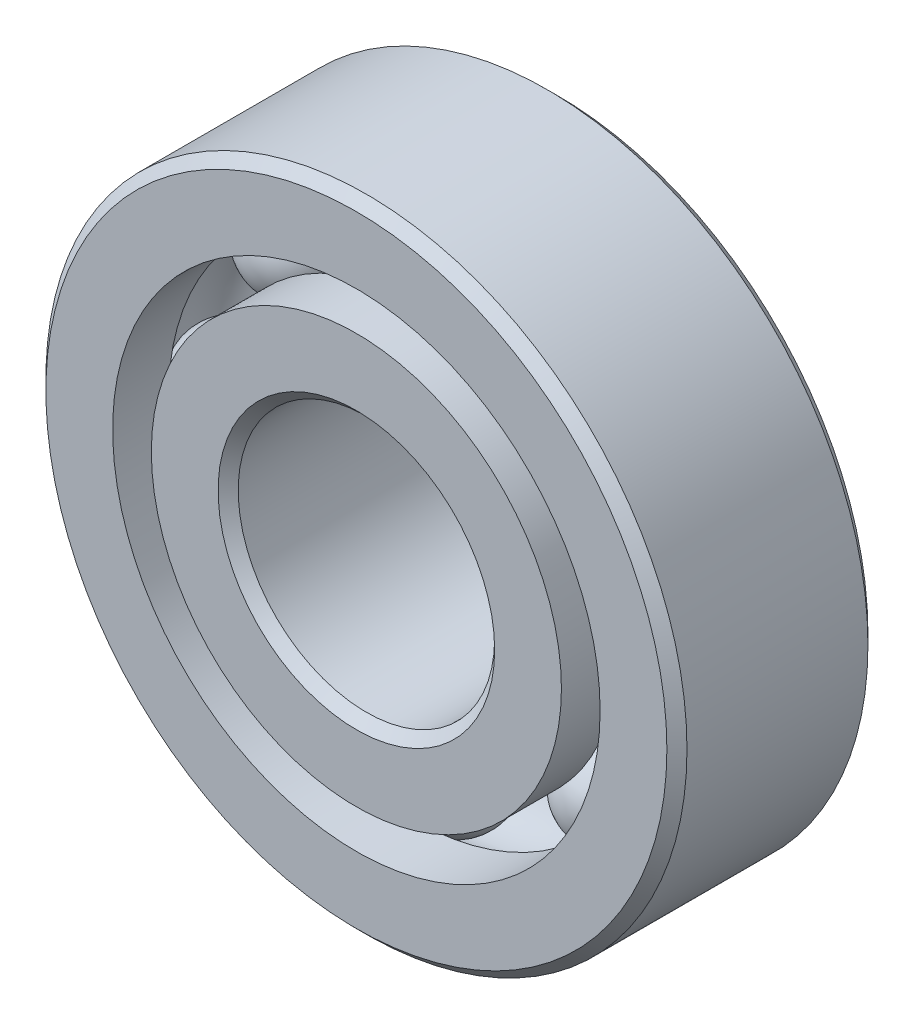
from build123d import *

# Parameters (mm, degrees)
CIRPATTERN1_COUNT = 8


with BuildPart() as part:
    # Sketch1 → Revolve1 (revolve)
    with BuildSketch(Plane(origin=(0, 0, 0), x_dir=(0, 0, -1), z_dir=(1, 0, 0)), mode=Mode.PRIVATE) as revolve1_sk:
        with BuildLine():
            Line((2.24028, 7.9375), (-2.24028, 7.9375))
            Line((-2.24028, 7.9375), (-2.4892, 7.68858))
            Line((-2.4892, 7.68858), (-2.4892, 6.035221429))
            Line((-2.4892, 6.035221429), (-1.106311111, 6.035221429))
            ThreePointArc((-1.106311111, 6.035221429), (0, 6.76179465), (1.106311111, 6.035221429))
            Line((1.106311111, 6.035221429), (2.4892, 6.035221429))
            Line((2.4892, 6.035221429), (2.4892, 7.68858))
            Line((2.4892, 7.68858), (2.24028, 7.9375))
        make_face()
    revolve(revolve1_sk.sketch.rotate(Axis((0, 0, 2.4892), (0, 0, -1)), 90), axis=Axis((0, 0, 2.4892), (0, 0, -1)))


with BuildPart() as body_2:
    # Sketch3 → Revolve3 (revolve)
    with BuildSketch(Plane(origin=(0, 0, 0), x_dir=(0, 0, -1), z_dir=(1, 0, 0)), mode=Mode.PRIVATE) as revolve3_sk:
        with BuildLine():
            Line((-2.4892, 5.077278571), (-1.106311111, 5.077278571))
            ThreePointArc((-1.106311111, 5.077278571), (0, 4.35070535), (1.106311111, 5.077278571))
            Line((1.106311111, 5.077278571), (2.4892, 5.077278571))
            Line((2.4892, 5.077278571), (2.4892, 3.42392))
            Line((2.4892, 3.42392), (2.24028, 3.175))
            Line((2.24028, 3.175), (-2.24028, 3.175))
            Line((-2.24028, 3.175), (-2.4892, 3.42392))
            Line((-2.4892, 3.42392), (-2.4892, 5.077278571))
        make_face()
    revolve(revolve3_sk.sketch.rotate(Axis((0, 0, 2.4892), (0, 0, -1)), 90), axis=Axis((0, 0, 2.4892), (0, 0, -1)))


with BuildPart() as body_3:
    # Sketch4 → Revolve4 (revolve)
    with BuildSketch(Plane(origin=(0, 0, 0), x_dir=(0, 0, -1), z_dir=(1, 0, 0))):
        with BuildLine():
            Line((-1.20554465, 5.55625), (1.20554465, 5.55625))
            ThreePointArc((1.20554465, 5.55625), (0, 6.76179465), (-1.20554465, 5.55625))
        make_face()
    revolve(axis=Axis((0, 5.55625, 1.20554465), (0, 0, -1)))


with BuildPart() as cirpattern1_1:
    # CirPattern1: pattern copy
    add(body_3.part.rotate(Axis((0, 0, 0), (0, 0, 1)), 1 * 360 / CIRPATTERN1_COUNT))


with BuildPart() as cirpattern1_2:
    # CirPattern1: pattern copy
    add(body_3.part.rotate(Axis((0, 0, 0), (0, 0, 1)), 2 * 360 / CIRPATTERN1_COUNT))


with BuildPart() as cirpattern1_3:
    # CirPattern1: pattern copy
    add(body_3.part.rotate(Axis((0, 0, 0), (0, 0, 1)), 3 * 360 / CIRPATTERN1_COUNT))


with BuildPart() as cirpattern1_4:
    # CirPattern1: pattern copy
    add(body_3.part.rotate(Axis((0, 0, 0), (0, 0, 1)), 4 * 360 / CIRPATTERN1_COUNT))


with BuildPart() as cirpattern1_5:
    # CirPattern1: pattern copy
    add(body_3.part.rotate(Axis((0, 0, 0), (0, 0, 1)), 5 * 360 / CIRPATTERN1_COUNT))


with BuildPart() as cirpattern1_6:
    # CirPattern1: pattern copy
    add(body_3.part.rotate(Axis((0, 0, 0), (0, 0, 1)), 6 * 360 / CIRPATTERN1_COUNT))


with BuildPart() as cirpattern1_7:
    # CirPattern1: pattern copy
    add(body_3.part.rotate(Axis((0, 0, 0), (0, 0, 1)), 7 * 360 / CIRPATTERN1_COUNT))


solid = Compound([part.part, body_2.part, body_3.part, cirpattern1_1.part, cirpattern1_2.part, cirpattern1_3.part, cirpattern1_4.part, cirpattern1_5.part, cirpattern1_6.part, cirpattern1_7.part])
